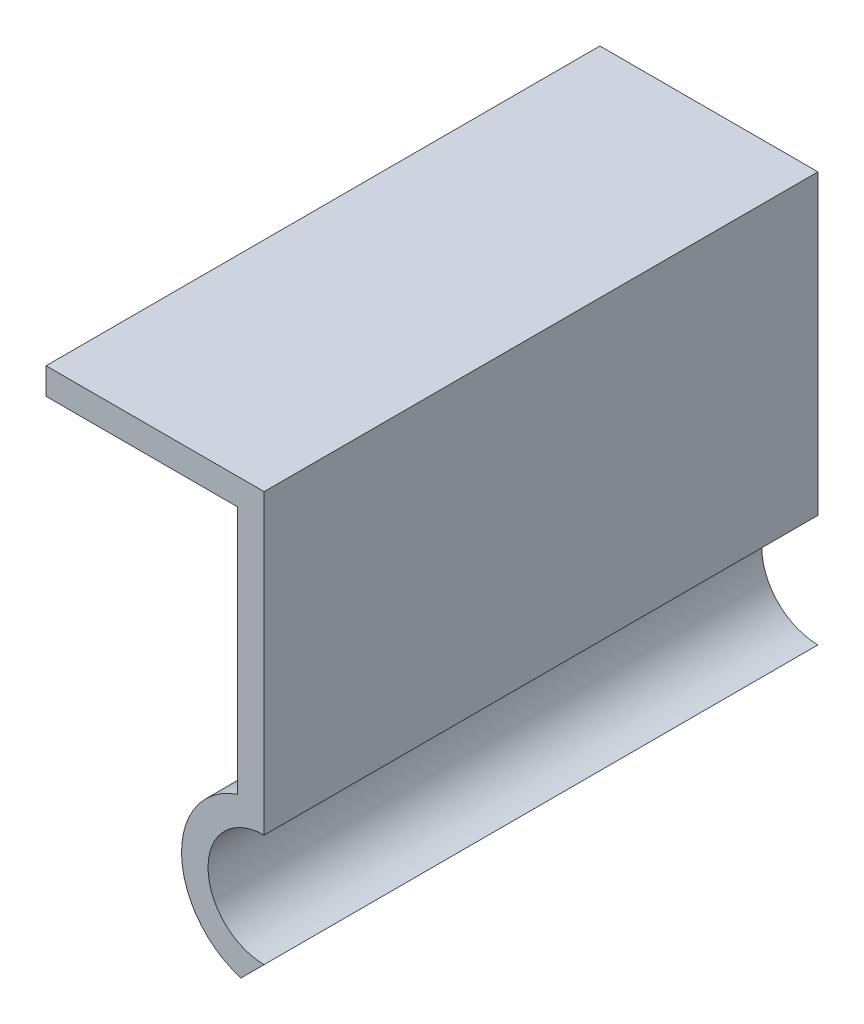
from build123d import *

# Parameters (mm, degrees)
EXTRUDE1_DEPTH = 25.4


with BuildPart() as part:
    # Sketch1 → Extrude1 (new body)
    with BuildSketch(Plane.XY):
        with BuildLine():
            Line((0, 0), (0, -13.642))
            ThreePointArc((0, -13.642), (-2.572, -16.214), (0, -18.786))
            Line((0, -18.786), (-1.061999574, -19.847999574))
            ThreePointArc((-1.061999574, -19.847999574), (-3.785161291, -16.293686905), (-1.214, -12.627915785))
            Line((-1.214, -12.627915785), (-1.214, -1.214))
            Line((-1.214, -1.214), (-10, -1.214))
            Line((-10, -1.214), (-10, 0))
            Line((-10, 0), (0, 0))
        make_face()
    extrude(amount=EXTRUDE1_DEPTH)


solid = part.part
